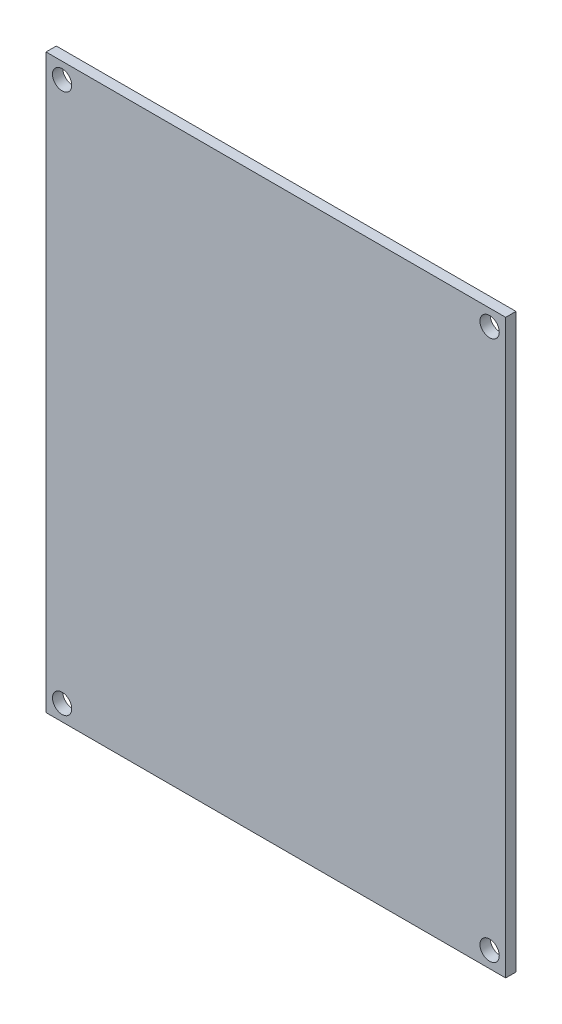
ISO-10303-21;
HEADER;
FILE_DESCRIPTION(('STEP AP214'),'2;1');
FILE_NAME('part.step','',(''),(''),'','','');
FILE_SCHEMA(('AUTOMOTIVE_DESIGN { 1 0 10303 214 1 1 1 1 }'));
ENDSEC;
DATA;
#1=APPLICATION_CONTEXT('core data for automotive mechanical design processes');
#2=APPLICATION_PROTOCOL_DEFINITION('international standard','automotive_design',2000,#1);
#3=PRODUCT_CONTEXT('',#1,'mechanical');
#4=PRODUCT('Part','Part','',(#3));
#5=PRODUCT_RELATED_PRODUCT_CATEGORY('part','',(#4));
#6=PRODUCT_DEFINITION_FORMATION('','',#4);
#7=PRODUCT_DEFINITION_CONTEXT('part definition',#1,'design');
#8=PRODUCT_DEFINITION('design','',#6,#7);
#9=PRODUCT_DEFINITION_SHAPE('','',#8);
#10=(LENGTH_UNIT() NAMED_UNIT(*) SI_UNIT(.MILLI.,.METRE.));
#11=(NAMED_UNIT(*) PLANE_ANGLE_UNIT() SI_UNIT($,.RADIAN.));
#12=(NAMED_UNIT(*) SI_UNIT($,.STERADIAN.) SOLID_ANGLE_UNIT());
#13=UNCERTAINTY_MEASURE_WITH_UNIT(LENGTH_MEASURE(1.E-05),#10,'distance_accuracy_value','');
#14=(GEOMETRIC_REPRESENTATION_CONTEXT(3) GLOBAL_UNCERTAINTY_ASSIGNED_CONTEXT((#13)) GLOBAL_UNIT_ASSIGNED_CONTEXT((#10,
#11,#12)) REPRESENTATION_CONTEXT('',''));
#15=CARTESIAN_POINT('',(0.,0.,0.));
#16=DIRECTION('',(0.,0.,1.));
#17=DIRECTION('',(1.,0.,0.));
#18=AXIS2_PLACEMENT_3D('',#15,#16,#17);
#19=CARTESIAN_POINT('',(0.,0.,1.6));
#20=DIRECTION('',(0.,0.,-1.));
#21=DIRECTION('',(-1.,0.,0.));
#22=AXIS2_PLACEMENT_3D('',#19,#20,#21);
#23=PLANE('',#22);
#24=DIRECTION('',(1.,0.,0.));
#25=VECTOR('',#24,1.);
#26=CARTESIAN_POINT('',(87.5000000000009,-44.5000000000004,1.6));
#27=LINE('',#26,#25);
#28=CARTESIAN_POINT('',(16.0000000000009,-44.5000000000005,1.6));
#29=VERTEX_POINT('',#28);
#30=CARTESIAN_POINT('',(87.5000000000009,-44.5000000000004,1.6));
#31=VERTEX_POINT('',#30);
#32=EDGE_CURVE('E87',#29,#31,#27,.T.);
#33=ORIENTED_EDGE('',*,*,#32,.T.);
#34=DIRECTION('',(0.,1.,0.));
#35=VECTOR('',#34,1.);
#36=CARTESIAN_POINT('',(87.5000000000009,-44.5000000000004,1.6));
#37=LINE('',#36,#35);
#38=CARTESIAN_POINT('',(87.5000000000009,44.5,1.6));
#39=VERTEX_POINT('',#38);
#40=EDGE_CURVE('E82',#31,#39,#37,.T.);
#41=ORIENTED_EDGE('',*,*,#40,.T.);
#42=DIRECTION('',(-1.,0.,0.));
#43=VECTOR('',#42,1.);
#44=CARTESIAN_POINT('',(87.5000000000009,44.5,1.6));
#45=LINE('',#44,#43);
#46=CARTESIAN_POINT('',(16.0000000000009,44.5,1.6));
#47=VERTEX_POINT('',#46);
#48=EDGE_CURVE('E85',#39,#47,#45,.T.);
#49=ORIENTED_EDGE('',*,*,#48,.T.);
#50=DIRECTION('',(0.,-1.,0.));
#51=VECTOR('',#50,1.);
#52=CARTESIAN_POINT('',(16.0000000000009,-44.5000000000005,1.6));
#53=LINE('',#52,#51);
#54=EDGE_CURVE('E52',#47,#29,#53,.T.);
#55=ORIENTED_EDGE('',*,*,#54,.T.);
#56=EDGE_LOOP('',(#33,#41,#49,#55));
#57=FACE_BOUND('',#56,.T.);
#58=CARTESIAN_POINT('',(18.5000000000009,-42.0000000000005,1.6));
#59=DIRECTION('',(0.,0.,1.));
#60=DIRECTION('',(1.,0.,0.));
#61=AXIS2_PLACEMENT_3D('',#58,#59,#60);
#62=CIRCLE('',#61,1.49999999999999);
#63=CARTESIAN_POINT('',(20.0000000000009,-42.0000000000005,1.6));
#64=VERTEX_POINT('',#63);
#65=EDGE_CURVE('E102',#64,#64,#62,.T.);
#66=ORIENTED_EDGE('',*,*,#65,.F.);
#67=EDGE_LOOP('',(#66));
#68=FACE_BOUND('',#67,.T.);
#69=CARTESIAN_POINT('',(85.0000000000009,-42.,1.6));
#70=DIRECTION('',(0.,0.,1.));
#71=DIRECTION('',(1.,0.,0.));
#72=AXIS2_PLACEMENT_3D('',#69,#70,#71);
#73=CIRCLE('',#72,1.5);
#74=CARTESIAN_POINT('',(86.5000000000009,-42.,1.6));
#75=VERTEX_POINT('',#74);
#76=EDGE_CURVE('E117',#75,#75,#73,.T.);
#77=ORIENTED_EDGE('',*,*,#76,.F.);
#78=EDGE_LOOP('',(#77));
#79=FACE_BOUND('',#78,.T.);
#80=CARTESIAN_POINT('',(85.,42.,1.6));
#81=DIRECTION('',(0.,0.,1.));
#82=DIRECTION('',(1.,0.,0.));
#83=AXIS2_PLACEMENT_3D('',#80,#81,#82);
#84=CIRCLE('',#83,1.5);
#85=CARTESIAN_POINT('',(86.5,42.,1.6));
#86=VERTEX_POINT('',#85);
#87=EDGE_CURVE('E123',#86,#86,#84,.T.);
#88=ORIENTED_EDGE('',*,*,#87,.F.);
#89=EDGE_LOOP('',(#88));
#90=FACE_BOUND('',#89,.T.);
#91=CARTESIAN_POINT('',(18.5,41.9999999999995,1.6));
#92=DIRECTION('',(0.,0.,1.));
#93=DIRECTION('',(1.,0.,0.));
#94=AXIS2_PLACEMENT_3D('',#91,#92,#93);
#95=CIRCLE('',#94,1.49999999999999);
#96=CARTESIAN_POINT('',(20.,41.9999999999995,1.6));
#97=VERTEX_POINT('',#96);
#98=EDGE_CURVE('E129',#97,#97,#95,.T.);
#99=ORIENTED_EDGE('',*,*,#98,.F.);
#100=EDGE_LOOP('',(#99));
#101=FACE_BOUND('',#100,.T.);
#102=ADVANCED_FACE('F35',(#57,#68,#79,#90,#101),#23,.F.);
#103=CARTESIAN_POINT('',(0.,0.,0.));
#104=DIRECTION('',(0.,0.,-1.));
#105=DIRECTION('',(-1.,0.,0.));
#106=AXIS2_PLACEMENT_3D('',#103,#104,#105);
#107=PLANE('',#106);
#108=CARTESIAN_POINT('',(85.,42.,0.));
#109=DIRECTION('',(0.,0.,1.));
#110=DIRECTION('',(1.,0.,0.));
#111=AXIS2_PLACEMENT_3D('',#108,#109,#110);
#112=CIRCLE('',#111,1.5);
#113=CARTESIAN_POINT('',(86.5,42.,0.));
#114=VERTEX_POINT('',#113);
#115=EDGE_CURVE('E126',#114,#114,#112,.T.);
#116=ORIENTED_EDGE('',*,*,#115,.T.);
#117=EDGE_LOOP('',(#116));
#118=FACE_BOUND('',#117,.T.);
#119=CARTESIAN_POINT('',(18.5000000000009,-42.0000000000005,0.));
#120=DIRECTION('',(0.,0.,1.));
#121=DIRECTION('',(1.,0.,0.));
#122=AXIS2_PLACEMENT_3D('',#119,#120,#121);
#123=CIRCLE('',#122,1.49999999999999);
#124=CARTESIAN_POINT('',(20.0000000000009,-42.0000000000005,0.));
#125=VERTEX_POINT('',#124);
#126=EDGE_CURVE('E114',#125,#125,#123,.T.);
#127=ORIENTED_EDGE('',*,*,#126,.T.);
#128=EDGE_LOOP('',(#127));
#129=FACE_BOUND('',#128,.T.);
#130=DIRECTION('',(1.,0.,0.));
#131=VECTOR('',#130,1.);
#132=CARTESIAN_POINT('',(87.5000000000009,-44.5000000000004,0.));
#133=LINE('',#132,#131);
#134=CARTESIAN_POINT('',(16.0000000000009,-44.5000000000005,0.));
#135=VERTEX_POINT('',#134);
#136=CARTESIAN_POINT('',(87.5000000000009,-44.5000000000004,0.));
#137=VERTEX_POINT('',#136);
#138=EDGE_CURVE('E99',#135,#137,#133,.T.);
#139=ORIENTED_EDGE('',*,*,#138,.F.);
#140=DIRECTION('',(0.,-1.,0.));
#141=VECTOR('',#140,1.);
#142=CARTESIAN_POINT('',(16.0000000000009,-44.5000000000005,0.));
#143=LINE('',#142,#141);
#144=CARTESIAN_POINT('',(16.0000000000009,44.5,0.));
#145=VERTEX_POINT('',#144);
#146=EDGE_CURVE('E75',#145,#135,#143,.T.);
#147=ORIENTED_EDGE('',*,*,#146,.F.);
#148=DIRECTION('',(-1.,0.,0.));
#149=VECTOR('',#148,1.);
#150=CARTESIAN_POINT('',(87.5000000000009,44.5,0.));
#151=LINE('',#150,#149);
#152=CARTESIAN_POINT('',(87.5000000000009,44.5,0.));
#153=VERTEX_POINT('',#152);
#154=EDGE_CURVE('E69',#153,#145,#151,.T.);
#155=ORIENTED_EDGE('',*,*,#154,.F.);
#156=DIRECTION('',(0.,1.,0.));
#157=VECTOR('',#156,1.);
#158=CARTESIAN_POINT('',(87.5000000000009,-44.5000000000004,0.));
#159=LINE('',#158,#157);
#160=EDGE_CURVE('E91',#137,#153,#159,.T.);
#161=ORIENTED_EDGE('',*,*,#160,.F.);
#162=EDGE_LOOP('',(#139,#147,#155,#161));
#163=FACE_BOUND('',#162,.T.);
#164=CARTESIAN_POINT('',(85.0000000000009,-42.,0.));
#165=DIRECTION('',(0.,0.,1.));
#166=DIRECTION('',(1.,0.,0.));
#167=AXIS2_PLACEMENT_3D('',#164,#165,#166);
#168=CIRCLE('',#167,1.5);
#169=CARTESIAN_POINT('',(86.5000000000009,-42.,0.));
#170=VERTEX_POINT('',#169);
#171=EDGE_CURVE('E120',#170,#170,#168,.T.);
#172=ORIENTED_EDGE('',*,*,#171,.T.);
#173=EDGE_LOOP('',(#172));
#174=FACE_BOUND('',#173,.T.);
#175=CARTESIAN_POINT('',(18.5,41.9999999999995,0.));
#176=DIRECTION('',(0.,0.,1.));
#177=DIRECTION('',(1.,0.,0.));
#178=AXIS2_PLACEMENT_3D('',#175,#176,#177);
#179=CIRCLE('',#178,1.49999999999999);
#180=CARTESIAN_POINT('',(20.,41.9999999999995,0.));
#181=VERTEX_POINT('',#180);
#182=EDGE_CURVE('E132',#181,#181,#179,.T.);
#183=ORIENTED_EDGE('',*,*,#182,.T.);
#184=EDGE_LOOP('',(#183));
#185=FACE_BOUND('',#184,.T.);
#186=ADVANCED_FACE('F110',(#118,#129,#163,#174,#185),#107,.T.);
#187=CARTESIAN_POINT('',(87.5000000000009,-44.5000000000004,1.6));
#188=DIRECTION('',(0.,1.,0.));
#189=DIRECTION('',(-1.,0.,0.));
#190=AXIS2_PLACEMENT_3D('',#187,#188,#189);
#191=PLANE('',#190);
#192=ORIENTED_EDGE('',*,*,#138,.T.);
#193=DIRECTION('',(0.,0.,-1.));
#194=VECTOR('',#193,1.);
#195=CARTESIAN_POINT('',(87.5000000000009,-44.5000000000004,1.6));
#196=LINE('',#195,#194);
#197=EDGE_CURVE('E11',#31,#137,#196,.T.);
#198=ORIENTED_EDGE('',*,*,#197,.F.);
#199=ORIENTED_EDGE('',*,*,#32,.F.);
#200=DIRECTION('',(0.,0.,-1.));
#201=VECTOR('',#200,1.);
#202=CARTESIAN_POINT('',(16.0000000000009,-44.5000000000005,1.6));
#203=LINE('',#202,#201);
#204=EDGE_CURVE('E95',#29,#135,#203,.T.);
#205=ORIENTED_EDGE('',*,*,#204,.T.);
#206=EDGE_LOOP('',(#192,#198,#199,#205));
#207=FACE_BOUND('',#206,.T.);
#208=ADVANCED_FACE('F37',(#207),#191,.F.);
#209=CARTESIAN_POINT('',(87.5000000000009,-44.5000000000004,1.6));
#210=DIRECTION('',(-1.,0.,0.));
#211=DIRECTION('',(0.,0.,1.));
#212=AXIS2_PLACEMENT_3D('',#209,#210,#211);
#213=PLANE('',#212);
#214=ORIENTED_EDGE('',*,*,#160,.T.);
#215=DIRECTION('',(0.,0.,-1.));
#216=VECTOR('',#215,1.);
#217=CARTESIAN_POINT('',(87.5000000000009,44.5,1.6));
#218=LINE('',#217,#216);
#219=EDGE_CURVE('E44',#39,#153,#218,.T.);
#220=ORIENTED_EDGE('',*,*,#219,.F.);
#221=ORIENTED_EDGE('',*,*,#40,.F.);
#222=ORIENTED_EDGE('',*,*,#197,.T.);
#223=EDGE_LOOP('',(#214,#220,#221,#222));
#224=FACE_BOUND('',#223,.T.);
#225=ADVANCED_FACE('F90',(#224),#213,.F.);
#226=CARTESIAN_POINT('',(87.5000000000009,44.5,1.6));
#227=DIRECTION('',(0.,-1.,0.));
#228=DIRECTION('',(1.,0.,0.));
#229=AXIS2_PLACEMENT_3D('',#226,#227,#228);
#230=PLANE('',#229);
#231=ORIENTED_EDGE('',*,*,#154,.T.);
#232=DIRECTION('',(0.,0.,-1.));
#233=VECTOR('',#232,1.);
#234=CARTESIAN_POINT('',(16.0000000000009,44.5,1.6));
#235=LINE('',#234,#233);
#236=EDGE_CURVE('E92',#47,#145,#235,.T.);
#237=ORIENTED_EDGE('',*,*,#236,.F.);
#238=ORIENTED_EDGE('',*,*,#48,.F.);
#239=ORIENTED_EDGE('',*,*,#219,.T.);
#240=EDGE_LOOP('',(#231,#237,#238,#239));
#241=FACE_BOUND('',#240,.T.);
#242=ADVANCED_FACE('F93',(#241),#230,.F.);
#243=CARTESIAN_POINT('',(16.0000000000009,-44.5000000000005,1.6));
#244=DIRECTION('',(1.,0.,0.));
#245=DIRECTION('',(0.,1.,0.));
#246=AXIS2_PLACEMENT_3D('',#243,#244,#245);
#247=PLANE('',#246);
#248=ORIENTED_EDGE('',*,*,#146,.T.);
#249=ORIENTED_EDGE('',*,*,#204,.F.);
#250=ORIENTED_EDGE('',*,*,#54,.F.);
#251=ORIENTED_EDGE('',*,*,#236,.T.);
#252=EDGE_LOOP('',(#248,#249,#250,#251));
#253=FACE_BOUND('',#252,.T.);
#254=ADVANCED_FACE('F107',(#253),#247,.F.);
#255=CARTESIAN_POINT('',(18.5000000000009,-42.0000000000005,1.6));
#256=DIRECTION('',(0.,0.,-1.));
#257=DIRECTION('',(-1.,0.,0.));
#258=AXIS2_PLACEMENT_3D('',#255,#256,#257);
#259=CYLINDRICAL_SURFACE('',#258,1.49999999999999);
#260=ORIENTED_EDGE('',*,*,#65,.T.);
#261=EDGE_LOOP('',(#260));
#262=FACE_BOUND('',#261,.T.);
#263=ORIENTED_EDGE('',*,*,#126,.F.);
#264=EDGE_LOOP('',(#263));
#265=FACE_BOUND('',#264,.T.);
#266=ADVANCED_FACE('F149',(#262,#265),#259,.F.);
#267=CARTESIAN_POINT('',(85.0000000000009,-42.,1.6));
#268=DIRECTION('',(0.,0.,-1.));
#269=DIRECTION('',(-1.,0.,0.));
#270=AXIS2_PLACEMENT_3D('',#267,#268,#269);
#271=CYLINDRICAL_SURFACE('',#270,1.5);
#272=ORIENTED_EDGE('',*,*,#76,.T.);
#273=EDGE_LOOP('',(#272));
#274=FACE_BOUND('',#273,.T.);
#275=ORIENTED_EDGE('',*,*,#171,.F.);
#276=EDGE_LOOP('',(#275));
#277=FACE_BOUND('',#276,.T.);
#278=ADVANCED_FACE('F195',(#274,#277),#271,.F.);
#279=CARTESIAN_POINT('',(85.,42.,1.6));
#280=DIRECTION('',(0.,0.,-1.));
#281=DIRECTION('',(-1.,0.,0.));
#282=AXIS2_PLACEMENT_3D('',#279,#280,#281);
#283=CYLINDRICAL_SURFACE('',#282,1.5);
#284=ORIENTED_EDGE('',*,*,#87,.T.);
#285=EDGE_LOOP('',(#284));
#286=FACE_BOUND('',#285,.T.);
#287=ORIENTED_EDGE('',*,*,#115,.F.);
#288=EDGE_LOOP('',(#287));
#289=FACE_BOUND('',#288,.T.);
#290=ADVANCED_FACE('F203',(#286,#289),#283,.F.);
#291=CARTESIAN_POINT('',(18.5,41.9999999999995,1.6));
#292=DIRECTION('',(0.,0.,-1.));
#293=DIRECTION('',(-1.,0.,0.));
#294=AXIS2_PLACEMENT_3D('',#291,#292,#293);
#295=CYLINDRICAL_SURFACE('',#294,1.49999999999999);
#296=ORIENTED_EDGE('',*,*,#98,.T.);
#297=EDGE_LOOP('',(#296));
#298=FACE_BOUND('',#297,.T.);
#299=ORIENTED_EDGE('',*,*,#182,.F.);
#300=EDGE_LOOP('',(#299));
#301=FACE_BOUND('',#300,.T.);
#302=ADVANCED_FACE('F138',(#298,#301),#295,.F.);
#303=CLOSED_SHELL('',(#102,#186,#208,#225,#242,#254,#266,#278,#290,#302));
#304=MANIFOLD_SOLID_BREP('B2',#303);
#305=ADVANCED_BREP_SHAPE_REPRESENTATION('',(#18,#304),#14);
#306=SHAPE_DEFINITION_REPRESENTATION(#9,#305);
ENDSEC;
END-ISO-10303-21;
